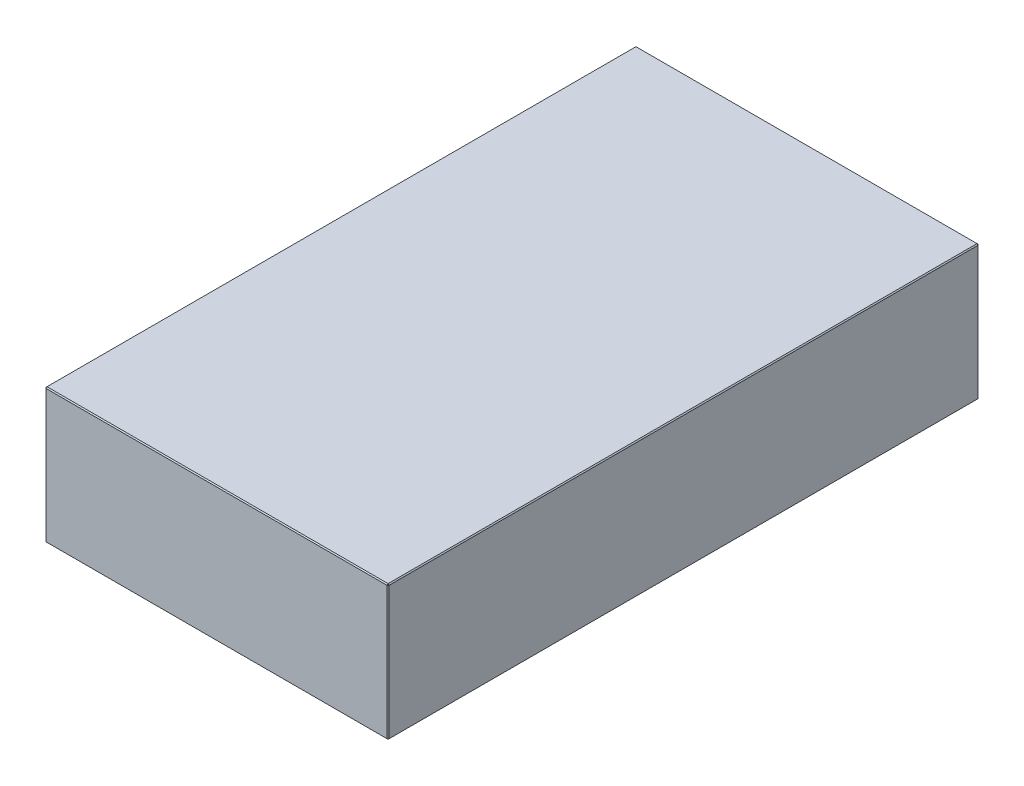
ISO-10303-21;
HEADER;
FILE_DESCRIPTION(('STEP AP214'),'2;1');
FILE_NAME('part.step','',(''),(''),'','','');
FILE_SCHEMA(('AUTOMOTIVE_DESIGN { 1 0 10303 214 1 1 1 1 }'));
ENDSEC;
DATA;
#1=APPLICATION_CONTEXT('core data for automotive mechanical design processes');
#2=APPLICATION_PROTOCOL_DEFINITION('international standard','automotive_design',2000,#1);
#3=PRODUCT_CONTEXT('',#1,'mechanical');
#4=PRODUCT('Part','Part','',(#3));
#5=PRODUCT_RELATED_PRODUCT_CATEGORY('part','',(#4));
#6=PRODUCT_DEFINITION_FORMATION('','',#4);
#7=PRODUCT_DEFINITION_CONTEXT('part definition',#1,'design');
#8=PRODUCT_DEFINITION('design','',#6,#7);
#9=PRODUCT_DEFINITION_SHAPE('','',#8);
#10=(LENGTH_UNIT() NAMED_UNIT(*) SI_UNIT(.MILLI.,.METRE.));
#11=(NAMED_UNIT(*) PLANE_ANGLE_UNIT() SI_UNIT($,.RADIAN.));
#12=(NAMED_UNIT(*) SI_UNIT($,.STERADIAN.) SOLID_ANGLE_UNIT());
#13=UNCERTAINTY_MEASURE_WITH_UNIT(LENGTH_MEASURE(1.E-05),#10,'distance_accuracy_value','');
#14=(GEOMETRIC_REPRESENTATION_CONTEXT(3) GLOBAL_UNCERTAINTY_ASSIGNED_CONTEXT((#13)) GLOBAL_UNIT_ASSIGNED_CONTEXT((#10,
#11,#12)) REPRESENTATION_CONTEXT('',''));
#15=CARTESIAN_POINT('',(0.,0.,0.));
#16=DIRECTION('',(0.,0.,1.));
#17=DIRECTION('',(1.,0.,0.));
#18=AXIS2_PLACEMENT_3D('',#15,#16,#17);
#19=CARTESIAN_POINT('',(-173.,136.,298.));
#20=DIRECTION('',(1.,0.,0.));
#21=DIRECTION('',(0.,0.,-1.));
#22=AXIS2_PLACEMENT_3D('',#19,#20,#21);
#23=PLANE('',#22);
#24=DIRECTION('',(0.,-1.,0.));
#25=VECTOR('',#24,1.);
#26=CARTESIAN_POINT('',(-173.,136.,-297.));
#27=LINE('',#26,#25);
#28=CARTESIAN_POINT('',(-173.,135.,-297.));
#29=VERTEX_POINT('',#28);
#30=CARTESIAN_POINT('',(-173.,1.,-297.));
#31=VERTEX_POINT('',#30);
#32=EDGE_CURVE('E114',#29,#31,#27,.T.);
#33=ORIENTED_EDGE('',*,*,#32,.T.);
#34=DIRECTION('',(0.,0.,1.));
#35=VECTOR('',#34,1.);
#36=CARTESIAN_POINT('',(-173.,1.,298.));
#37=LINE('',#36,#35);
#38=CARTESIAN_POINT('',(-173.,1.,297.));
#39=VERTEX_POINT('',#38);
#40=EDGE_CURVE('E110',#31,#39,#37,.T.);
#41=ORIENTED_EDGE('',*,*,#40,.T.);
#42=DIRECTION('',(0.,1.,0.));
#43=VECTOR('',#42,1.);
#44=CARTESIAN_POINT('',(-173.,136.,297.));
#45=LINE('',#44,#43);
#46=CARTESIAN_POINT('',(-173.,135.,297.));
#47=VERTEX_POINT('',#46);
#48=EDGE_CURVE('E103',#39,#47,#45,.T.);
#49=ORIENTED_EDGE('',*,*,#48,.T.);
#50=DIRECTION('',(0.,0.,-1.));
#51=VECTOR('',#50,1.);
#52=CARTESIAN_POINT('',(-173.,135.,-298.));
#53=LINE('',#52,#51);
#54=EDGE_CURVE('E107',#47,#29,#53,.T.);
#55=ORIENTED_EDGE('',*,*,#54,.T.);
#56=EDGE_LOOP('',(#33,#41,#49,#55));
#57=FACE_BOUND('',#56,.T.);
#58=ADVANCED_FACE('F15',(#57),#23,.F.);
#59=CARTESIAN_POINT('',(173.,136.,298.));
#60=DIRECTION('',(0.,0.,-1.));
#61=DIRECTION('',(-1.,0.,0.));
#62=AXIS2_PLACEMENT_3D('',#59,#60,#61);
#63=PLANE('',#62);
#64=DIRECTION('',(-1.,0.,0.));
#65=VECTOR('',#64,1.);
#66=CARTESIAN_POINT('',(-173.,135.,298.));
#67=LINE('',#66,#65);
#68=CARTESIAN_POINT('',(172.,135.,298.));
#69=VERTEX_POINT('',#68);
#70=CARTESIAN_POINT('',(-172.,135.,298.));
#71=VERTEX_POINT('',#70);
#72=EDGE_CURVE('E164',#69,#71,#67,.T.);
#73=ORIENTED_EDGE('',*,*,#72,.T.);
#74=DIRECTION('',(0.,-1.,0.));
#75=VECTOR('',#74,1.);
#76=CARTESIAN_POINT('',(-172.,136.,298.));
#77=LINE('',#76,#75);
#78=CARTESIAN_POINT('',(-172.,1.,298.));
#79=VERTEX_POINT('',#78);
#80=EDGE_CURVE('E122',#71,#79,#77,.T.);
#81=ORIENTED_EDGE('',*,*,#80,.T.);
#82=DIRECTION('',(1.,0.,0.));
#83=VECTOR('',#82,1.);
#84=CARTESIAN_POINT('',(173.,1.,298.));
#85=LINE('',#84,#83);
#86=CARTESIAN_POINT('',(172.,1.,298.));
#87=VERTEX_POINT('',#86);
#88=EDGE_CURVE('E168',#79,#87,#85,.T.);
#89=ORIENTED_EDGE('',*,*,#88,.T.);
#90=DIRECTION('',(0.,1.,0.));
#91=VECTOR('',#90,1.);
#92=CARTESIAN_POINT('',(172.,136.,298.));
#93=LINE('',#92,#91);
#94=EDGE_CURVE('E166',#87,#69,#93,.T.);
#95=ORIENTED_EDGE('',*,*,#94,.T.);
#96=EDGE_LOOP('',(#73,#81,#89,#95));
#97=FACE_BOUND('',#96,.T.);
#98=ADVANCED_FACE('F275',(#97),#63,.F.);
#99=CARTESIAN_POINT('',(173.,136.,298.));
#100=DIRECTION('',(-1.,0.,0.));
#101=DIRECTION('',(0.,0.,1.));
#102=AXIS2_PLACEMENT_3D('',#99,#100,#101);
#103=PLANE('',#102);
#104=DIRECTION('',(0.,0.,-1.));
#105=VECTOR('',#104,1.);
#106=CARTESIAN_POINT('',(173.,1.,298.));
#107=LINE('',#106,#105);
#108=CARTESIAN_POINT('',(173.,1.,297.));
#109=VERTEX_POINT('',#108);
#110=CARTESIAN_POINT('',(173.,1.,-297.));
#111=VERTEX_POINT('',#110);
#112=EDGE_CURVE('E159',#109,#111,#107,.T.);
#113=ORIENTED_EDGE('',*,*,#112,.T.);
#114=DIRECTION('',(0.,1.,0.));
#115=VECTOR('',#114,1.);
#116=CARTESIAN_POINT('',(173.,136.,-297.));
#117=LINE('',#116,#115);
#118=CARTESIAN_POINT('',(173.,135.,-297.));
#119=VERTEX_POINT('',#118);
#120=EDGE_CURVE('E161',#111,#119,#117,.T.);
#121=ORIENTED_EDGE('',*,*,#120,.T.);
#122=DIRECTION('',(0.,0.,1.));
#123=VECTOR('',#122,1.);
#124=CARTESIAN_POINT('',(173.,135.,298.));
#125=LINE('',#124,#123);
#126=CARTESIAN_POINT('',(173.,135.,297.));
#127=VERTEX_POINT('',#126);
#128=EDGE_CURVE('E155',#119,#127,#125,.T.);
#129=ORIENTED_EDGE('',*,*,#128,.T.);
#130=DIRECTION('',(0.,-1.,0.));
#131=VECTOR('',#130,1.);
#132=CARTESIAN_POINT('',(173.,136.,297.));
#133=LINE('',#132,#131);
#134=EDGE_CURVE('E157',#127,#109,#133,.T.);
#135=ORIENTED_EDGE('',*,*,#134,.T.);
#136=EDGE_LOOP('',(#113,#121,#129,#135));
#137=FACE_BOUND('',#136,.T.);
#138=ADVANCED_FACE('F254',(#137),#103,.F.);
#139=CARTESIAN_POINT('',(173.,136.,-298.));
#140=DIRECTION('',(0.,0.,1.));
#141=DIRECTION('',(1.,0.,0.));
#142=AXIS2_PLACEMENT_3D('',#139,#140,#141);
#143=PLANE('',#142);
#144=DIRECTION('',(0.,-1.,0.));
#145=VECTOR('',#144,1.);
#146=CARTESIAN_POINT('',(172.,136.,-298.));
#147=LINE('',#146,#145);
#148=CARTESIAN_POINT('',(172.,135.,-298.));
#149=VERTEX_POINT('',#148);
#150=CARTESIAN_POINT('',(172.,1.,-298.));
#151=VERTEX_POINT('',#150);
#152=EDGE_CURVE('E148',#149,#151,#147,.T.);
#153=ORIENTED_EDGE('',*,*,#152,.T.);
#154=DIRECTION('',(-1.,0.,0.));
#155=VECTOR('',#154,1.);
#156=CARTESIAN_POINT('',(173.,1.,-298.));
#157=LINE('',#156,#155);
#158=CARTESIAN_POINT('',(-172.,1.,-298.));
#159=VERTEX_POINT('',#158);
#160=EDGE_CURVE('E153',#151,#159,#157,.T.);
#161=ORIENTED_EDGE('',*,*,#160,.T.);
#162=DIRECTION('',(0.,1.,0.));
#163=VECTOR('',#162,1.);
#164=CARTESIAN_POINT('',(-172.,136.,-298.));
#165=LINE('',#164,#163);
#166=CARTESIAN_POINT('',(-172.,135.,-298.));
#167=VERTEX_POINT('',#166);
#168=EDGE_CURVE('E150',#159,#167,#165,.T.);
#169=ORIENTED_EDGE('',*,*,#168,.T.);
#170=DIRECTION('',(1.,0.,0.));
#171=VECTOR('',#170,1.);
#172=CARTESIAN_POINT('',(173.,135.,-298.));
#173=LINE('',#172,#171);
#174=EDGE_CURVE('E146',#167,#149,#173,.T.);
#175=ORIENTED_EDGE('',*,*,#174,.T.);
#176=EDGE_LOOP('',(#153,#161,#169,#175));
#177=FACE_BOUND('',#176,.T.);
#178=ADVANCED_FACE('F284',(#177),#143,.F.);
#179=CARTESIAN_POINT('',(0.,136.,0.));
#180=DIRECTION('',(0.,1.,0.));
#181=DIRECTION('',(0.,0.,1.));
#182=AXIS2_PLACEMENT_3D('',#179,#180,#181);
#183=PLANE('',#182);
#184=DIRECTION('',(0.,0.,-1.));
#185=VECTOR('',#184,1.);
#186=CARTESIAN_POINT('',(172.,136.,-298.));
#187=LINE('',#186,#185);
#188=CARTESIAN_POINT('',(172.,136.,297.));
#189=VERTEX_POINT('',#188);
#190=CARTESIAN_POINT('',(172.,136.,-297.));
#191=VERTEX_POINT('',#190);
#192=EDGE_CURVE('E24',#189,#191,#187,.T.);
#193=ORIENTED_EDGE('',*,*,#192,.T.);
#194=DIRECTION('',(-1.,0.,0.));
#195=VECTOR('',#194,1.);
#196=CARTESIAN_POINT('',(-173.,136.,-297.));
#197=LINE('',#196,#195);
#198=CARTESIAN_POINT('',(-172.,136.,-297.));
#199=VERTEX_POINT('',#198);
#200=EDGE_CURVE('E9',#191,#199,#197,.T.);
#201=ORIENTED_EDGE('',*,*,#200,.T.);
#202=DIRECTION('',(0.,0.,1.));
#203=VECTOR('',#202,1.);
#204=CARTESIAN_POINT('',(-172.,136.,298.));
#205=LINE('',#204,#203);
#206=CARTESIAN_POINT('',(-172.,136.,297.));
#207=VERTEX_POINT('',#206);
#208=EDGE_CURVE('E180',#199,#207,#205,.T.);
#209=ORIENTED_EDGE('',*,*,#208,.T.);
#210=DIRECTION('',(1.,0.,0.));
#211=VECTOR('',#210,1.);
#212=CARTESIAN_POINT('',(173.,136.,297.));
#213=LINE('',#212,#211);
#214=EDGE_CURVE('E35',#207,#189,#213,.T.);
#215=ORIENTED_EDGE('',*,*,#214,.T.);
#216=EDGE_LOOP('',(#193,#201,#209,#215));
#217=FACE_BOUND('',#216,.T.);
#218=ADVANCED_FACE('F350',(#217),#183,.T.);
#219=CARTESIAN_POINT('',(0.,0.,0.));
#220=DIRECTION('',(0.,1.,0.));
#221=DIRECTION('',(0.,0.,1.));
#222=AXIS2_PLACEMENT_3D('',#219,#220,#221);
#223=PLANE('',#222);
#224=DIRECTION('',(0.,0.,1.));
#225=VECTOR('',#224,1.);
#226=CARTESIAN_POINT('',(172.,0.,0.));
#227=LINE('',#226,#225);
#228=CARTESIAN_POINT('',(172.,0.,-297.));
#229=VERTEX_POINT('',#228);
#230=CARTESIAN_POINT('',(172.,0.,297.));
#231=VERTEX_POINT('',#230);
#232=EDGE_CURVE('E171',#229,#231,#227,.T.);
#233=ORIENTED_EDGE('',*,*,#232,.T.);
#234=DIRECTION('',(-1.,0.,0.));
#235=VECTOR('',#234,1.);
#236=CARTESIAN_POINT('',(0.,0.,297.));
#237=LINE('',#236,#235);
#238=CARTESIAN_POINT('',(-172.,0.,297.));
#239=VERTEX_POINT('',#238);
#240=EDGE_CURVE('E177',#231,#239,#237,.T.);
#241=ORIENTED_EDGE('',*,*,#240,.T.);
#242=DIRECTION('',(0.,0.,-1.));
#243=VECTOR('',#242,1.);
#244=CARTESIAN_POINT('',(-172.,0.,0.));
#245=LINE('',#244,#243);
#246=CARTESIAN_POINT('',(-172.,0.,-297.));
#247=VERTEX_POINT('',#246);
#248=EDGE_CURVE('E175',#239,#247,#245,.T.);
#249=ORIENTED_EDGE('',*,*,#248,.T.);
#250=DIRECTION('',(1.,0.,0.));
#251=VECTOR('',#250,1.);
#252=CARTESIAN_POINT('',(0.,0.,-297.));
#253=LINE('',#252,#251);
#254=EDGE_CURVE('E173',#247,#229,#253,.T.);
#255=ORIENTED_EDGE('',*,*,#254,.T.);
#256=EDGE_LOOP('',(#233,#241,#249,#255));
#257=FACE_BOUND('',#256,.T.);
#258=ADVANCED_FACE('F246',(#257),#223,.F.);
#259=CARTESIAN_POINT('',(173.,136.,297.));
#260=DIRECTION('',(-0.707106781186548,0.,-0.707106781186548));
#261=DIRECTION('',(0.,-1.,0.));
#262=AXIS2_PLACEMENT_3D('',#259,#260,#261);
#263=PLANE('',#262);
#264=DIRECTION('',(-0.707106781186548,0.,0.707106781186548));
#265=VECTOR('',#264,1.);
#266=CARTESIAN_POINT('',(172.,135.,298.));
#267=LINE('',#266,#265);
#268=EDGE_CURVE('E19',#69,#127,#267,.F.);
#269=ORIENTED_EDGE('',*,*,#268,.F.);
#270=ORIENTED_EDGE('',*,*,#94,.F.);
#271=DIRECTION('',(0.707106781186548,0.,-0.707106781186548));
#272=VECTOR('',#271,1.);
#273=CARTESIAN_POINT('',(172.,1.,298.));
#274=LINE('',#273,#272);
#275=EDGE_CURVE('E142',#109,#87,#274,.F.);
#276=ORIENTED_EDGE('',*,*,#275,.F.);
#277=ORIENTED_EDGE('',*,*,#134,.F.);
#278=EDGE_LOOP('',(#269,#270,#276,#277));
#279=FACE_BOUND('',#278,.T.);
#280=ADVANCED_FACE('F17',(#279),#263,.F.);
#281=CARTESIAN_POINT('',(172.,135.,298.));
#282=DIRECTION('',(0.577350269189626,0.577350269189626,0.577350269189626));
#283=DIRECTION('',(0.707106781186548,0.,-0.707106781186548));
#284=AXIS2_PLACEMENT_3D('',#281,#282,#283);
#285=PLANE('',#284);
#286=DIRECTION('',(0.,-0.707106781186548,0.707106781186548));
#287=VECTOR('',#286,1.);
#288=CARTESIAN_POINT('',(172.,135.,298.));
#289=LINE('',#288,#287);
#290=EDGE_CURVE('E226',#69,#189,#289,.F.);
#291=ORIENTED_EDGE('',*,*,#290,.F.);
#292=ORIENTED_EDGE('',*,*,#268,.T.);
#293=DIRECTION('',(-0.707106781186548,0.707106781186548,0.));
#294=VECTOR('',#293,1.);
#295=CARTESIAN_POINT('',(172.5,135.5,297.));
#296=LINE('',#295,#294);
#297=EDGE_CURVE('E228',#189,#127,#296,.F.);
#298=ORIENTED_EDGE('',*,*,#297,.F.);
#299=EDGE_LOOP('',(#291,#292,#298));
#300=FACE_BOUND('',#299,.T.);
#301=ADVANCED_FACE('F270',(#300),#285,.T.);
#302=CARTESIAN_POINT('',(172.,1.,298.));
#303=DIRECTION('',(0.577350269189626,-0.577350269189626,0.577350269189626));
#304=DIRECTION('',(0.707106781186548,0.,-0.707106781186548));
#305=AXIS2_PLACEMENT_3D('',#302,#303,#304);
#306=PLANE('',#305);
#307=DIRECTION('',(-0.707106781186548,-0.707106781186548,0.));
#308=VECTOR('',#307,1.);
#309=CARTESIAN_POINT('',(172.5,0.5,297.));
#310=LINE('',#309,#308);
#311=EDGE_CURVE('E220',#109,#231,#310,.T.);
#312=ORIENTED_EDGE('',*,*,#311,.F.);
#313=ORIENTED_EDGE('',*,*,#275,.T.);
#314=DIRECTION('',(0.,0.707106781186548,0.707106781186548));
#315=VECTOR('',#314,1.);
#316=CARTESIAN_POINT('',(172.,1.,298.));
#317=LINE('',#316,#315);
#318=EDGE_CURVE('E223',#231,#87,#317,.T.);
#319=ORIENTED_EDGE('',*,*,#318,.F.);
#320=EDGE_LOOP('',(#312,#313,#319));
#321=FACE_BOUND('',#320,.T.);
#322=ADVANCED_FACE('F235',(#321),#306,.T.);
#323=CARTESIAN_POINT('',(172.,136.,0.));
#324=DIRECTION('',(0.707106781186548,0.707106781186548,0.));
#325=DIRECTION('',(0.,0.,1.));
#326=AXIS2_PLACEMENT_3D('',#323,#324,#325);
#327=PLANE('',#326);
#328=ORIENTED_EDGE('',*,*,#297,.T.);
#329=ORIENTED_EDGE('',*,*,#128,.F.);
#330=DIRECTION('',(0.707106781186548,-0.707106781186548,0.));
#331=VECTOR('',#330,1.);
#332=CARTESIAN_POINT('',(173.,135.,-297.));
#333=LINE('',#332,#331);
#334=EDGE_CURVE('E215',#191,#119,#333,.T.);
#335=ORIENTED_EDGE('',*,*,#334,.F.);
#336=ORIENTED_EDGE('',*,*,#192,.F.);
#337=EDGE_LOOP('',(#328,#329,#335,#336));
#338=FACE_BOUND('',#337,.T.);
#339=ADVANCED_FACE('F265',(#338),#327,.T.);
#340=CARTESIAN_POINT('',(0.,136.,297.));
#341=DIRECTION('',(0.,0.707106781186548,0.707106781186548));
#342=DIRECTION('',(-1.,0.,0.));
#343=AXIS2_PLACEMENT_3D('',#340,#341,#342);
#344=PLANE('',#343);
#345=ORIENTED_EDGE('',*,*,#290,.T.);
#346=ORIENTED_EDGE('',*,*,#214,.F.);
#347=DIRECTION('',(0.,0.707106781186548,-0.707106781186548));
#348=VECTOR('',#347,1.);
#349=CARTESIAN_POINT('',(-172.,135.5,297.5));
#350=LINE('',#349,#348);
#351=EDGE_CURVE('E126',#71,#207,#350,.T.);
#352=ORIENTED_EDGE('',*,*,#351,.F.);
#353=ORIENTED_EDGE('',*,*,#72,.F.);
#354=EDGE_LOOP('',(#345,#346,#352,#353));
#355=FACE_BOUND('',#354,.T.);
#356=ADVANCED_FACE('F273',(#355),#344,.T.);
#357=CARTESIAN_POINT('',(-172.,136.,298.));
#358=DIRECTION('',(0.707106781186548,0.,-0.707106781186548));
#359=DIRECTION('',(0.,-1.,0.));
#360=AXIS2_PLACEMENT_3D('',#357,#358,#359);
#361=PLANE('',#360);
#362=DIRECTION('',(0.707106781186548,0.,0.707106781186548));
#363=VECTOR('',#362,1.);
#364=CARTESIAN_POINT('',(-172.,1.,298.));
#365=LINE('',#364,#363);
#366=EDGE_CURVE('E127',#79,#39,#365,.F.);
#367=ORIENTED_EDGE('',*,*,#366,.F.);
#368=ORIENTED_EDGE('',*,*,#80,.F.);
#369=DIRECTION('',(-0.707106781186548,0.,-0.707106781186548));
#370=VECTOR('',#369,1.);
#371=CARTESIAN_POINT('',(-173.,135.,297.));
#372=LINE('',#371,#370);
#373=EDGE_CURVE('E118',#47,#71,#372,.F.);
#374=ORIENTED_EDGE('',*,*,#373,.F.);
#375=ORIENTED_EDGE('',*,*,#48,.F.);
#376=EDGE_LOOP('',(#367,#368,#374,#375));
#377=FACE_BOUND('',#376,.T.);
#378=ADVANCED_FACE('F120',(#377),#361,.F.);
#379=CARTESIAN_POINT('',(173.,1.,298.));
#380=DIRECTION('',(0.,0.707106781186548,-0.707106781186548));
#381=DIRECTION('',(1.,0.,0.));
#382=AXIS2_PLACEMENT_3D('',#379,#380,#381);
#383=PLANE('',#382);
#384=ORIENTED_EDGE('',*,*,#318,.T.);
#385=ORIENTED_EDGE('',*,*,#88,.F.);
#386=DIRECTION('',(0.,-0.707106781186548,-0.707106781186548));
#387=VECTOR('',#386,1.);
#388=CARTESIAN_POINT('',(-172.,1.,298.));
#389=LINE('',#388,#387);
#390=EDGE_CURVE('E211',#239,#79,#389,.F.);
#391=ORIENTED_EDGE('',*,*,#390,.F.);
#392=ORIENTED_EDGE('',*,*,#240,.F.);
#393=EDGE_LOOP('',(#384,#385,#391,#392));
#394=FACE_BOUND('',#393,.T.);
#395=ADVANCED_FACE('F243',(#394),#383,.F.);
#396=CARTESIAN_POINT('',(173.,1.,298.));
#397=DIRECTION('',(-0.707106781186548,0.707106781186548,0.));
#398=DIRECTION('',(0.,0.,-1.));
#399=AXIS2_PLACEMENT_3D('',#396,#397,#398);
#400=PLANE('',#399);
#401=ORIENTED_EDGE('',*,*,#311,.T.);
#402=ORIENTED_EDGE('',*,*,#232,.F.);
#403=DIRECTION('',(0.707106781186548,0.707106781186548,0.));
#404=VECTOR('',#403,1.);
#405=CARTESIAN_POINT('',(172.5,0.5,-297.));
#406=LINE('',#405,#404);
#407=EDGE_CURVE('E208',#111,#229,#406,.F.);
#408=ORIENTED_EDGE('',*,*,#407,.F.);
#409=ORIENTED_EDGE('',*,*,#112,.F.);
#410=EDGE_LOOP('',(#401,#402,#408,#409));
#411=FACE_BOUND('',#410,.T.);
#412=ADVANCED_FACE('F251',(#411),#400,.F.);
#413=CARTESIAN_POINT('',(172.,136.,-298.));
#414=DIRECTION('',(-0.707106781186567,0.,0.707106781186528));
#415=DIRECTION('',(0.,-1.,0.));
#416=AXIS2_PLACEMENT_3D('',#413,#414,#415);
#417=PLANE('',#416);
#418=DIRECTION('',(0.707106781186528,0.,0.707106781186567));
#419=VECTOR('',#418,1.);
#420=CARTESIAN_POINT('',(173.,135.,-297.));
#421=LINE('',#420,#419);
#422=EDGE_CURVE('E217',#119,#149,#421,.F.);
#423=ORIENTED_EDGE('',*,*,#422,.F.);
#424=ORIENTED_EDGE('',*,*,#120,.F.);
#425=DIRECTION('',(-0.707106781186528,0.,-0.707106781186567));
#426=VECTOR('',#425,1.);
#427=CARTESIAN_POINT('',(172.,1.,-298.));
#428=LINE('',#427,#426);
#429=EDGE_CURVE('E205',#151,#111,#428,.F.);
#430=ORIENTED_EDGE('',*,*,#429,.F.);
#431=ORIENTED_EDGE('',*,*,#152,.F.);
#432=EDGE_LOOP('',(#423,#424,#430,#431));
#433=FACE_BOUND('',#432,.T.);
#434=ADVANCED_FACE('F258',(#433),#417,.F.);
#435=CARTESIAN_POINT('',(173.,135.,-297.));
#436=DIRECTION('',(0.577350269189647,0.577350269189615,-0.577350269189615));
#437=DIRECTION('',(-0.707106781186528,0.,-0.707106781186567));
#438=AXIS2_PLACEMENT_3D('',#435,#436,#437);
#439=PLANE('',#438);
#440=ORIENTED_EDGE('',*,*,#334,.T.);
#441=ORIENTED_EDGE('',*,*,#422,.T.);
#442=DIRECTION('',(0.,0.707106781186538,0.707106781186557));
#443=VECTOR('',#442,1.);
#444=CARTESIAN_POINT('',(172.,135.5,-297.5));
#445=LINE('',#444,#443);
#446=EDGE_CURVE('E134',#191,#149,#445,.F.);
#447=ORIENTED_EDGE('',*,*,#446,.F.);
#448=EDGE_LOOP('',(#440,#441,#447));
#449=FACE_BOUND('',#448,.T.);
#450=ADVANCED_FACE('F325',(#449),#439,.T.);
#451=CARTESIAN_POINT('',(-173.,135.,297.));
#452=DIRECTION('',(-0.577350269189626,0.577350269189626,0.577350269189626));
#453=DIRECTION('',(0.707106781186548,0.,0.707106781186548));
#454=AXIS2_PLACEMENT_3D('',#451,#452,#453);
#455=PLANE('',#454);
#456=ORIENTED_EDGE('',*,*,#373,.T.);
#457=ORIENTED_EDGE('',*,*,#351,.T.);
#458=DIRECTION('',(-0.707106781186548,-0.707106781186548,0.));
#459=VECTOR('',#458,1.);
#460=CARTESIAN_POINT('',(-173.,135.,297.));
#461=LINE('',#460,#459);
#462=EDGE_CURVE('E130',#47,#207,#461,.F.);
#463=ORIENTED_EDGE('',*,*,#462,.F.);
#464=EDGE_LOOP('',(#456,#457,#463));
#465=FACE_BOUND('',#464,.T.);
#466=ADVANCED_FACE('F131',(#465),#455,.T.);
#467=CARTESIAN_POINT('',(-172.,1.,298.));
#468=DIRECTION('',(-0.577350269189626,-0.577350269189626,0.577350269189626));
#469=DIRECTION('',(0.707106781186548,0.,0.707106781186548));
#470=AXIS2_PLACEMENT_3D('',#467,#468,#469);
#471=PLANE('',#470);
#472=ORIENTED_EDGE('',*,*,#390,.T.);
#473=ORIENTED_EDGE('',*,*,#366,.T.);
#474=DIRECTION('',(-0.707106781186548,0.707106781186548,0.));
#475=VECTOR('',#474,1.);
#476=CARTESIAN_POINT('',(-172.5,0.5,297.));
#477=LINE('',#476,#475);
#478=EDGE_CURVE('E135',#239,#39,#477,.T.);
#479=ORIENTED_EDGE('',*,*,#478,.F.);
#480=EDGE_LOOP('',(#472,#473,#479));
#481=FACE_BOUND('',#480,.T.);
#482=ADVANCED_FACE('F318',(#481),#471,.T.);
#483=CARTESIAN_POINT('',(172.,1.,-298.));
#484=DIRECTION('',(0.577350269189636,-0.577350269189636,-0.577350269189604));
#485=DIRECTION('',(0.707106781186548,0.707106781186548,0.));
#486=AXIS2_PLACEMENT_3D('',#483,#484,#485);
#487=PLANE('',#486);
#488=ORIENTED_EDGE('',*,*,#429,.T.);
#489=ORIENTED_EDGE('',*,*,#407,.T.);
#490=DIRECTION('',(0.,-0.707106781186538,0.707106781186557));
#491=VECTOR('',#490,1.);
#492=CARTESIAN_POINT('',(172.,1.,-298.));
#493=LINE('',#492,#491);
#494=EDGE_CURVE('E198',#151,#229,#493,.T.);
#495=ORIENTED_EDGE('',*,*,#494,.F.);
#496=EDGE_LOOP('',(#488,#489,#495));
#497=FACE_BOUND('',#496,.T.);
#498=ADVANCED_FACE('F314',(#497),#487,.T.);
#499=CARTESIAN_POINT('',(0.,136.,-297.));
#500=DIRECTION('',(0.,0.707106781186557,-0.707106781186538));
#501=DIRECTION('',(1.,0.,0.));
#502=AXIS2_PLACEMENT_3D('',#499,#500,#501);
#503=PLANE('',#502);
#504=ORIENTED_EDGE('',*,*,#446,.T.);
#505=ORIENTED_EDGE('',*,*,#174,.F.);
#506=DIRECTION('',(0.,-0.707106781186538,-0.707106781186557));
#507=VECTOR('',#506,1.);
#508=CARTESIAN_POINT('',(-172.,135.,-298.));
#509=LINE('',#508,#507);
#510=EDGE_CURVE('E195',#199,#167,#509,.T.);
#511=ORIENTED_EDGE('',*,*,#510,.F.);
#512=ORIENTED_EDGE('',*,*,#200,.F.);
#513=EDGE_LOOP('',(#504,#505,#511,#512));
#514=FACE_BOUND('',#513,.T.);
#515=ADVANCED_FACE('F311',(#514),#503,.T.);
#516=CARTESIAN_POINT('',(-172.,136.,0.));
#517=DIRECTION('',(-0.707106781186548,0.707106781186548,0.));
#518=DIRECTION('',(0.,0.,-1.));
#519=AXIS2_PLACEMENT_3D('',#516,#517,#518);
#520=PLANE('',#519);
#521=ORIENTED_EDGE('',*,*,#462,.T.);
#522=ORIENTED_EDGE('',*,*,#208,.F.);
#523=DIRECTION('',(0.707106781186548,0.707106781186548,0.));
#524=VECTOR('',#523,1.);
#525=CARTESIAN_POINT('',(-172.5,135.5,-297.));
#526=LINE('',#525,#524);
#527=EDGE_CURVE('E138',#29,#199,#526,.T.);
#528=ORIENTED_EDGE('',*,*,#527,.F.);
#529=ORIENTED_EDGE('',*,*,#54,.F.);
#530=EDGE_LOOP('',(#521,#522,#528,#529));
#531=FACE_BOUND('',#530,.T.);
#532=ADVANCED_FACE('F137',(#531),#520,.T.);
#533=CARTESIAN_POINT('',(-173.,1.,298.));
#534=DIRECTION('',(0.707106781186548,0.707106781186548,0.));
#535=DIRECTION('',(0.,0.,1.));
#536=AXIS2_PLACEMENT_3D('',#533,#534,#535);
#537=PLANE('',#536);
#538=ORIENTED_EDGE('',*,*,#478,.T.);
#539=ORIENTED_EDGE('',*,*,#40,.F.);
#540=DIRECTION('',(0.707106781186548,-0.707106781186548,0.));
#541=VECTOR('',#540,1.);
#542=CARTESIAN_POINT('',(-173.,1.,-297.));
#543=LINE('',#542,#541);
#544=EDGE_CURVE('E191',#247,#31,#543,.F.);
#545=ORIENTED_EDGE('',*,*,#544,.F.);
#546=ORIENTED_EDGE('',*,*,#248,.F.);
#547=EDGE_LOOP('',(#538,#539,#545,#546));
#548=FACE_BOUND('',#547,.T.);
#549=ADVANCED_FACE('F304',(#548),#537,.F.);
#550=CARTESIAN_POINT('',(173.,1.,-298.));
#551=DIRECTION('',(0.,0.707106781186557,0.707106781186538));
#552=DIRECTION('',(-1.,0.,0.));
#553=AXIS2_PLACEMENT_3D('',#550,#551,#552);
#554=PLANE('',#553);
#555=ORIENTED_EDGE('',*,*,#494,.T.);
#556=ORIENTED_EDGE('',*,*,#254,.F.);
#557=DIRECTION('',(0.,0.707106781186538,-0.707106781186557));
#558=VECTOR('',#557,1.);
#559=CARTESIAN_POINT('',(-172.,0.500000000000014,-297.5));
#560=LINE('',#559,#558);
#561=EDGE_CURVE('E188',#159,#247,#560,.F.);
#562=ORIENTED_EDGE('',*,*,#561,.F.);
#563=ORIENTED_EDGE('',*,*,#160,.F.);
#564=EDGE_LOOP('',(#555,#556,#562,#563));
#565=FACE_BOUND('',#564,.T.);
#566=ADVANCED_FACE('F300',(#565),#554,.F.);
#567=CARTESIAN_POINT('',(-172.,135.,-298.));
#568=DIRECTION('',(-0.577350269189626,0.577350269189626,-0.577350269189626));
#569=DIRECTION('',(-0.707106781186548,0.,0.707106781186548));
#570=AXIS2_PLACEMENT_3D('',#567,#568,#569);
#571=PLANE('',#570);
#572=ORIENTED_EDGE('',*,*,#527,.T.);
#573=ORIENTED_EDGE('',*,*,#510,.T.);
#574=DIRECTION('',(0.707106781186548,0.,-0.707106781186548));
#575=VECTOR('',#574,1.);
#576=CARTESIAN_POINT('',(-172.,135.,-298.));
#577=LINE('',#576,#575);
#578=EDGE_CURVE('E186',#29,#167,#577,.T.);
#579=ORIENTED_EDGE('',*,*,#578,.F.);
#580=EDGE_LOOP('',(#572,#573,#579));
#581=FACE_BOUND('',#580,.T.);
#582=ADVANCED_FACE('F296',(#581),#571,.T.);
#583=CARTESIAN_POINT('',(-173.,1.,-297.));
#584=DIRECTION('',(-0.577350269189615,-0.577350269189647,-0.577350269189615));
#585=DIRECTION('',(0.,0.707106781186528,-0.707106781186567));
#586=AXIS2_PLACEMENT_3D('',#583,#584,#585);
#587=PLANE('',#586);
#588=ORIENTED_EDGE('',*,*,#561,.T.);
#589=ORIENTED_EDGE('',*,*,#544,.T.);
#590=DIRECTION('',(-0.707106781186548,0.,0.707106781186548));
#591=VECTOR('',#590,1.);
#592=CARTESIAN_POINT('',(-173.,1.,-297.));
#593=LINE('',#592,#591);
#594=EDGE_CURVE('E184',#159,#31,#593,.T.);
#595=ORIENTED_EDGE('',*,*,#594,.F.);
#596=EDGE_LOOP('',(#588,#589,#595));
#597=FACE_BOUND('',#596,.T.);
#598=ADVANCED_FACE('F292',(#597),#587,.T.);
#599=CARTESIAN_POINT('',(-173.,136.,-297.));
#600=DIRECTION('',(0.707106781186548,0.,0.707106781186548));
#601=DIRECTION('',(0.,-1.,0.));
#602=AXIS2_PLACEMENT_3D('',#599,#600,#601);
#603=PLANE('',#602);
#604=ORIENTED_EDGE('',*,*,#578,.T.);
#605=ORIENTED_EDGE('',*,*,#168,.F.);
#606=ORIENTED_EDGE('',*,*,#594,.T.);
#607=ORIENTED_EDGE('',*,*,#32,.F.);
#608=EDGE_LOOP('',(#604,#605,#606,#607));
#609=FACE_BOUND('',#608,.T.);
#610=ADVANCED_FACE('F289',(#609),#603,.F.);
#611=CLOSED_SHELL('',(#58,#98,#138,#178,#218,#258,#280,#301,#322,#339,#356,#378,#395,#412,#434,
#450,#466,#482,#498,#515,#532,#549,#566,#582,#598,#610));
#612=MANIFOLD_SOLID_BREP('B1',#611);
#613=ADVANCED_BREP_SHAPE_REPRESENTATION('',(#18,#612),#14);
#614=SHAPE_DEFINITION_REPRESENTATION(#9,#613);
ENDSEC;
END-ISO-10303-21;
